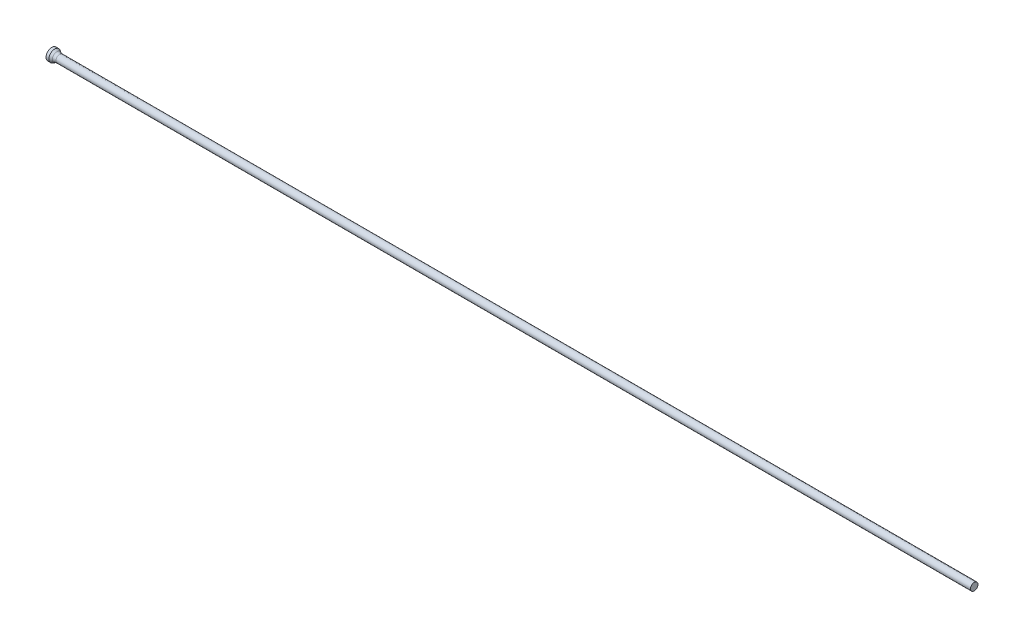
ISO-10303-21;
HEADER;
FILE_DESCRIPTION(('STEP AP214'),'2;1');
FILE_NAME('part.step','',(''),(''),'','','');
FILE_SCHEMA(('AUTOMOTIVE_DESIGN { 1 0 10303 214 1 1 1 1 }'));
ENDSEC;
DATA;
#1=APPLICATION_CONTEXT('core data for automotive mechanical design processes');
#2=APPLICATION_PROTOCOL_DEFINITION('international standard','automotive_design',2000,#1);
#3=PRODUCT_CONTEXT('',#1,'mechanical');
#4=PRODUCT('Part','Part','',(#3));
#5=PRODUCT_RELATED_PRODUCT_CATEGORY('part','',(#4));
#6=PRODUCT_DEFINITION_FORMATION('','',#4);
#7=PRODUCT_DEFINITION_CONTEXT('part definition',#1,'design');
#8=PRODUCT_DEFINITION('design','',#6,#7);
#9=PRODUCT_DEFINITION_SHAPE('','',#8);
#10=(LENGTH_UNIT() NAMED_UNIT(*) SI_UNIT(.MILLI.,.METRE.));
#11=(NAMED_UNIT(*) PLANE_ANGLE_UNIT() SI_UNIT($,.RADIAN.));
#12=(NAMED_UNIT(*) SI_UNIT($,.STERADIAN.) SOLID_ANGLE_UNIT());
#13=UNCERTAINTY_MEASURE_WITH_UNIT(LENGTH_MEASURE(1.E-05),#10,'distance_accuracy_value','');
#14=(GEOMETRIC_REPRESENTATION_CONTEXT(3) GLOBAL_UNCERTAINTY_ASSIGNED_CONTEXT((#13)) GLOBAL_UNIT_ASSIGNED_CONTEXT((#10,
#11,#12)) REPRESENTATION_CONTEXT('',''));
#15=CARTESIAN_POINT('',(0.,0.,0.));
#16=DIRECTION('',(0.,0.,1.));
#17=DIRECTION('',(1.,0.,0.));
#18=AXIS2_PLACEMENT_3D('',#15,#16,#17);
#19=CARTESIAN_POINT('',(0.,0.,0.));
#20=DIRECTION('',(1.,0.,0.));
#21=DIRECTION('',(0.,0.,-1.));
#22=AXIS2_PLACEMENT_3D('',#19,#20,#21);
#23=PLANE('',#22);
#24=CARTESIAN_POINT('',(0.,0.,0.));
#25=DIRECTION('',(-1.,0.,0.));
#26=DIRECTION('',(0.,0.,1.));
#27=AXIS2_PLACEMENT_3D('',#24,#25,#26);
#28=CIRCLE('',#27,1.);
#29=CARTESIAN_POINT('',(0.,0.,1.));
#30=VERTEX_POINT('',#29);
#31=EDGE_CURVE('E25',#30,#30,#28,.T.);
#32=ORIENTED_EDGE('',*,*,#31,.T.);
#33=EDGE_LOOP('',(#32));
#34=FACE_BOUND('',#33,.T.);
#35=ADVANCED_FACE('F14',(#34),#23,.F.);
#36=CARTESIAN_POINT('',(0.,0.,0.));
#37=DIRECTION('',(-1.,0.,0.));
#38=DIRECTION('',(0.,0.,1.));
#39=AXIS2_PLACEMENT_3D('',#36,#37,#38);
#40=CYLINDRICAL_SURFACE('',#39,1.);
#41=ORIENTED_EDGE('',*,*,#31,.F.);
#42=EDGE_LOOP('',(#41));
#43=FACE_BOUND('',#42,.T.);
#44=CARTESIAN_POINT('',(0.503782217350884,0.,0.));
#45=DIRECTION('',(-1.,0.,0.));
#46=DIRECTION('',(0.,0.,1.));
#47=AXIS2_PLACEMENT_3D('',#44,#45,#46);
#48=CIRCLE('',#47,1.);
#49=CARTESIAN_POINT('',(0.503782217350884,0.,1.));
#50=VERTEX_POINT('',#49);
#51=EDGE_CURVE('E29',#50,#50,#48,.T.);
#52=ORIENTED_EDGE('',*,*,#51,.T.);
#53=EDGE_LOOP('',(#52));
#54=FACE_BOUND('',#53,.T.);
#55=ADVANCED_FACE('F53',(#43,#54),#40,.T.);
#56=CARTESIAN_POINT('',(1.11,0.,0.));
#57=DIRECTION('',(-1.,0.,0.));
#58=DIRECTION('',(0.,0.,1.));
#59=AXIS2_PLACEMENT_3D('',#56,#57,#58);
#60=CONICAL_SURFACE('',#59,0.65,0.523598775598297);
#61=CARTESIAN_POINT('',(0.877949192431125,0.,0.));
#62=DIRECTION('',(-1.,0.,0.));
#63=DIRECTION('',(0.,0.,1.));
#64=AXIS2_PLACEMENT_3D('',#61,#62,#63);
#65=CIRCLE('',#64,0.783974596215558);
#66=CARTESIAN_POINT('',(0.877949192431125,0.,0.783974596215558));
#67=VERTEX_POINT('',#66);
#68=EDGE_CURVE('E21',#67,#67,#65,.T.);
#69=ORIENTED_EDGE('',*,*,#68,.T.);
#70=EDGE_LOOP('',(#69));
#71=FACE_BOUND('',#70,.T.);
#72=ORIENTED_EDGE('',*,*,#51,.F.);
#73=EDGE_LOOP('',(#72));
#74=FACE_BOUND('',#73,.T.);
#75=ADVANCED_FACE('F50',(#71,#74),#60,.T.);
#76=CARTESIAN_POINT('',(0.,0.,0.));
#77=DIRECTION('',(-1.,0.,0.));
#78=DIRECTION('',(0.,0.,1.));
#79=AXIS2_PLACEMENT_3D('',#76,#77,#78);
#80=CYLINDRICAL_SURFACE('',#79,0.65);
#81=CARTESIAN_POINT('',(1.37794919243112,0.,0.));
#82=DIRECTION('',(-1.,0.,0.));
#83=DIRECTION('',(0.,0.,1.));
#84=AXIS2_PLACEMENT_3D('',#81,#82,#83);
#85=CIRCLE('',#84,0.65);
#86=CARTESIAN_POINT('',(1.37794919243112,0.,0.65));
#87=VERTEX_POINT('',#86);
#88=EDGE_CURVE('E9',#87,#87,#85,.F.);
#89=ORIENTED_EDGE('',*,*,#88,.T.);
#90=EDGE_LOOP('',(#89));
#91=FACE_BOUND('',#90,.T.);
#92=CARTESIAN_POINT('',(160.,0.,0.));
#93=DIRECTION('',(-1.,0.,0.));
#94=DIRECTION('',(0.,0.,1.));
#95=AXIS2_PLACEMENT_3D('',#92,#93,#94);
#96=CIRCLE('',#95,0.65);
#97=CARTESIAN_POINT('',(160.,0.,0.65));
#98=VERTEX_POINT('',#97);
#99=EDGE_CURVE('E34',#98,#98,#96,.T.);
#100=ORIENTED_EDGE('',*,*,#99,.T.);
#101=EDGE_LOOP('',(#100));
#102=FACE_BOUND('',#101,.T.);
#103=ADVANCED_FACE('F38',(#91,#102),#80,.T.);
#104=CARTESIAN_POINT('',(160.,0.65,0.));
#105=DIRECTION('',(-1.,0.,0.));
#106=DIRECTION('',(0.,0.,1.));
#107=AXIS2_PLACEMENT_3D('',#104,#105,#106);
#108=PLANE('',#107);
#109=ORIENTED_EDGE('',*,*,#99,.F.);
#110=EDGE_LOOP('',(#109));
#111=FACE_BOUND('',#110,.T.);
#112=ADVANCED_FACE('F40',(#111),#108,.F.);
#113=CARTESIAN_POINT('',(1.37794919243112,0.,0.));
#114=DIRECTION('',(-1.,0.,0.));
#115=DIRECTION('',(0.,0.,1.));
#116=AXIS2_PLACEMENT_3D('',#113,#114,#115);
#117=TOROIDAL_SURFACE('',#116,1.65,1.);
#118=ORIENTED_EDGE('',*,*,#88,.F.);
#119=EDGE_LOOP('',(#118));
#120=FACE_BOUND('',#119,.T.);
#121=ORIENTED_EDGE('',*,*,#68,.F.);
#122=EDGE_LOOP('',(#121));
#123=FACE_BOUND('',#122,.T.);
#124=ADVANCED_FACE('F16',(#120,#123),#117,.F.);
#125=CLOSED_SHELL('',(#35,#55,#75,#103,#112,#124));
#126=MANIFOLD_SOLID_BREP('B1',#125);
#127=ADVANCED_BREP_SHAPE_REPRESENTATION('',(#18,#126),#14);
#128=SHAPE_DEFINITION_REPRESENTATION(#9,#127);
ENDSEC;
END-ISO-10303-21;
